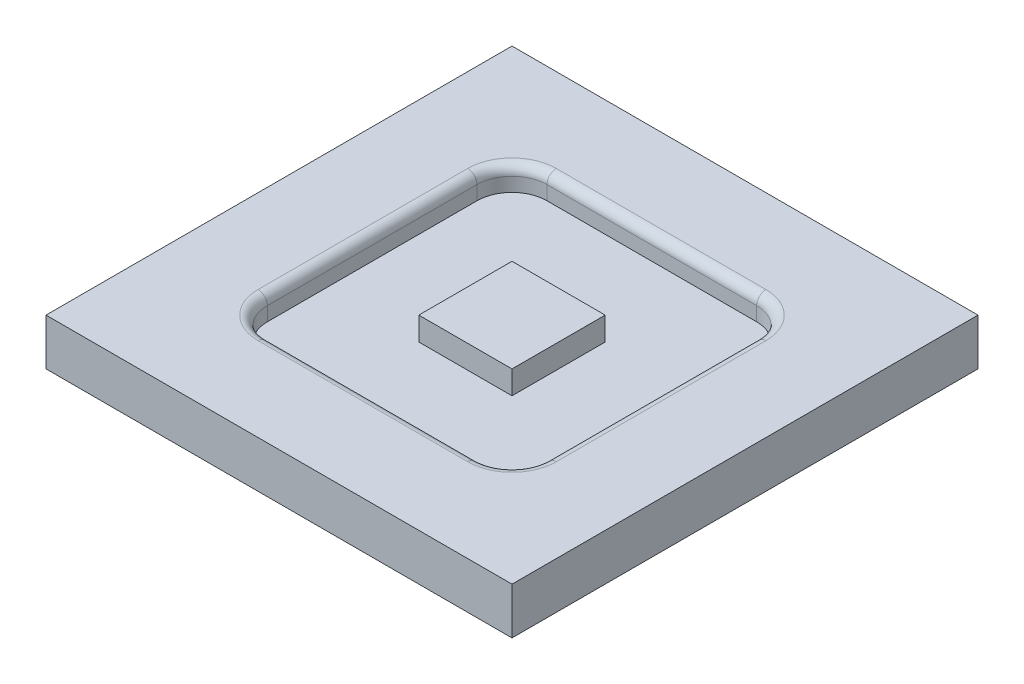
from build123d import *

# Parameters (mm, degrees)
SKETCH1_W          = 127
SKETCH1_H          = 127
EXTRUDE1_DEPTH     = 12.7
SKETCH2_W          = 76.2
SKETCH2_H          = 76.2
CUT_EXTRUDE1_DEPTH = 6.35
FILLET1_R          = 9.525
SKETCH3_W          = 25.4
SKETCH3_H          = 25.4
EXTRUDE2_DEPTH     = 6.35
FILLET2_R          = 2.54


with BuildPart() as part:
    # Sketch1 → Extrude1 (new body)
    with BuildSketch(Plane(origin=(0, 0, 0), x_dir=(1, 0, 0), z_dir=(0, 1, 0))):
        Rectangle(SKETCH1_W, SKETCH1_H)
    extrude(amount=EXTRUDE1_DEPTH)

    # Sketch2 → Cut-Extrude1 (cut)
    with BuildSketch(Plane(origin=(0, 12.7, 0), x_dir=(-1, 0, 0), z_dir=(0, 1, 0))):
        Rectangle(SKETCH2_W, SKETCH2_H)
    extrude(amount=-CUT_EXTRUDE1_DEPTH, mode=Mode.SUBTRACT)

    # Fillet1
    fillet1_edges = [part.edges().sort_by_distance(p)[0] for p in [
        (38.1, 9.525, -38.1),
        (38.1, 9.525, 38.1),
        (-38.1, 9.525, 38.1),
        (-38.1, 9.525, -38.1),
    ]]
    fillet(fillet1_edges, radius=FILLET1_R)

    # Sketch3 → Extrude2 (add)
    with BuildSketch(Plane(origin=(0, 6.35, 0), x_dir=(-1, 0, 0), z_dir=(0, 1, 0))):
        Rectangle(SKETCH3_W, SKETCH3_H)
    extrude(amount=EXTRUDE2_DEPTH)

    # Fillet2
    fillet2_edges = [part.edges().sort_by_distance(p)[0] for p in [
        (-38.1, 12.7, 0),
        (0, 12.7, -38.1),
        (0, 12.7, 38.1),
        (38.1, 12.7, 0),
        (-35.310192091, 12.7, -35.310192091),
        (-35.310192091, 12.7, 35.310192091),
        (35.310192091, 12.7, 35.310192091),
        (35.310192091, 12.7, -35.310192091),
    ]]
    fillet(fillet2_edges, radius=FILLET2_R)


solid = part.part
